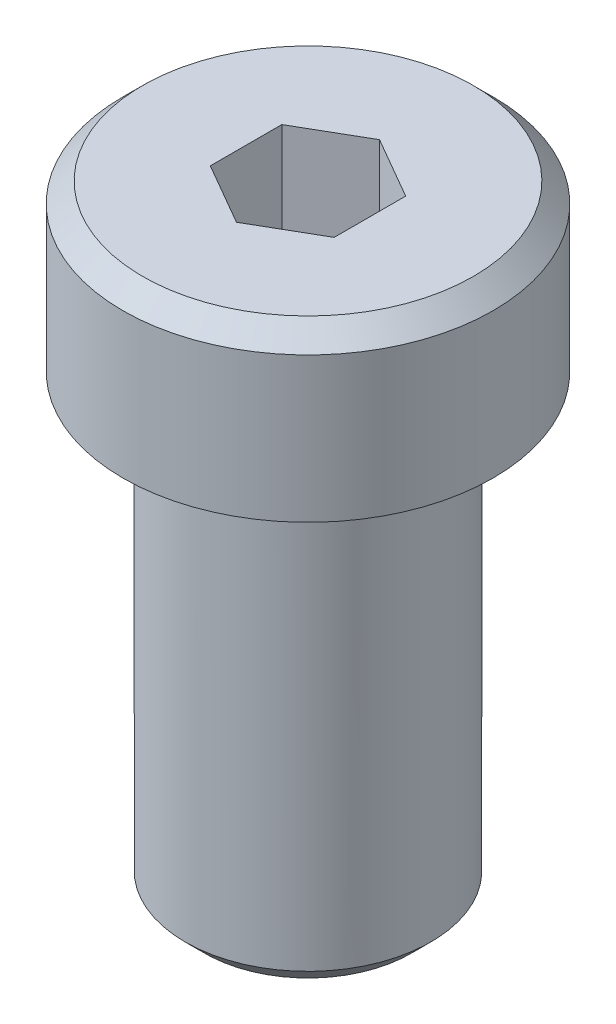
from build123d import *

# Parameters (mm, degrees)
SKETCH3_W          = 4.7371
SKETCH3_H          = 17.4498
CUT_EXTRUDE1_DEPTH = 3.581396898
CHAMFER1_SIZE      = 0.762


with BuildPart() as part:
    # Sketch2 → Base-Revolve (revolve)
    with BuildSketch(Plane.XY):
        Polygon((0, 0), (7.137393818, 0), (7.137393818, 5.5879945), (6.375393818, 6.3499945), (0, 6.3499945), align=None)
    revolve(axis=Axis((0, 0, 0), (0, 1, 0)))

    # Sketch3 → Boss-Revolve1 (revolve)
    with BuildSketch(Plane.XY, mode=Mode.PRIVATE) as boss_revolve1_sk:
        with Locations((2.36855, -8.7249)):
            Rectangle(SKETCH3_W, SKETCH3_H)
    revolve(boss_revolve1_sk.sketch.rotate(Axis((0, 0, 0), (0, 1, 0)), 90), axis=Axis((0, 0, 0), (0, 1, 0)))

    # Sketch4 → Cut-Extrude1 (cut)
    with BuildSketch(Plane(origin=(0, 6.3499945, 0), x_dir=(-1, 0, 0), z_dir=(0, 1, 0))):
        Polygon((2.387597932, 1.378480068), (6.25e-07, 2.756960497), (-2.387597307, 1.378481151), (-2.387598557, -1.378478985), (-1.876e-06, -2.756960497), (2.387596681, -1.378482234), align=None)
    extrude(amount=-CUT_EXTRUDE1_DEPTH, mode=Mode.SUBTRACT)

    # Chamfer1
    chamfer1_edges = [part.edges().sort_by_distance(p)[0] for p in [
        (0, -17.4498, 4.7371),
    ]]
    chamfer(chamfer1_edges, length=CHAMFER1_SIZE)


solid = part.part
